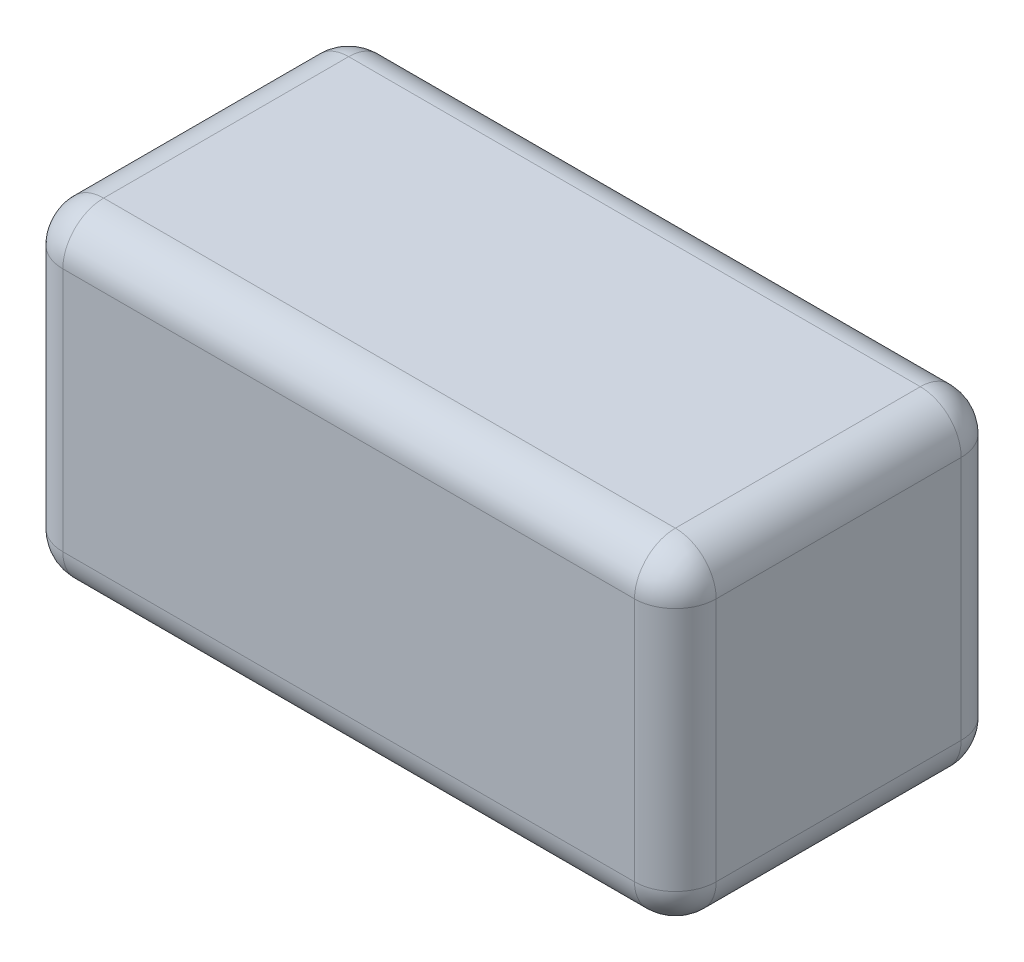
ISO-10303-21;
HEADER;
FILE_DESCRIPTION(('STEP AP214'),'2;1');
FILE_NAME('part.step','',(''),(''),'','','');
FILE_SCHEMA(('AUTOMOTIVE_DESIGN { 1 0 10303 214 1 1 1 1 }'));
ENDSEC;
DATA;
#1=APPLICATION_CONTEXT('core data for automotive mechanical design processes');
#2=APPLICATION_PROTOCOL_DEFINITION('international standard','automotive_design',2000,#1);
#3=PRODUCT_CONTEXT('',#1,'mechanical');
#4=PRODUCT('Part','Part','',(#3));
#5=PRODUCT_RELATED_PRODUCT_CATEGORY('part','',(#4));
#6=PRODUCT_DEFINITION_FORMATION('','',#4);
#7=PRODUCT_DEFINITION_CONTEXT('part definition',#1,'design');
#8=PRODUCT_DEFINITION('design','',#6,#7);
#9=PRODUCT_DEFINITION_SHAPE('','',#8);
#10=(LENGTH_UNIT() NAMED_UNIT(*) SI_UNIT(.MILLI.,.METRE.));
#11=(NAMED_UNIT(*) PLANE_ANGLE_UNIT() SI_UNIT($,.RADIAN.));
#12=(NAMED_UNIT(*) SI_UNIT($,.STERADIAN.) SOLID_ANGLE_UNIT());
#13=UNCERTAINTY_MEASURE_WITH_UNIT(LENGTH_MEASURE(1.E-05),#10,'distance_accuracy_value','');
#14=(GEOMETRIC_REPRESENTATION_CONTEXT(3) GLOBAL_UNCERTAINTY_ASSIGNED_CONTEXT((#13)) GLOBAL_UNIT_ASSIGNED_CONTEXT((#10,
#11,#12)) REPRESENTATION_CONTEXT('',''));
#15=CARTESIAN_POINT('',(0.,0.,0.));
#16=DIRECTION('',(0.,0.,1.));
#17=DIRECTION('',(1.,0.,0.));
#18=AXIS2_PLACEMENT_3D('',#15,#16,#17);
#19=CARTESIAN_POINT('',(-0.7,-0.3,0.7));
#20=DIRECTION('',(-1.,0.,0.));
#21=DIRECTION('',(0.,1.,0.));
#22=AXIS2_PLACEMENT_3D('',#19,#20,#21);
#23=SPHERICAL_SURFACE('',#22,0.1);
#24=CARTESIAN_POINT('',(-0.7,-0.3,0.7));
#25=DIRECTION('',(0.,0.,1.));
#26=DIRECTION('',(1.,0.,0.));
#27=AXIS2_PLACEMENT_3D('',#24,#25,#26);
#28=CIRCLE('',#27,0.1);
#29=CARTESIAN_POINT('',(-0.7,-0.4,0.7));
#30=VERTEX_POINT('',#29);
#31=CARTESIAN_POINT('',(-0.8,-0.3,0.7));
#32=VERTEX_POINT('',#31);
#33=EDGE_CURVE('E125',#30,#32,#28,.F.);
#34=ORIENTED_EDGE('',*,*,#33,.F.);
#35=CARTESIAN_POINT('',(-0.7,-0.3,0.7));
#36=DIRECTION('',(-1.,0.,0.));
#37=DIRECTION('',(0.,0.,1.));
#38=AXIS2_PLACEMENT_3D('',#35,#36,#37);
#39=CIRCLE('',#38,0.1);
#40=CARTESIAN_POINT('',(-0.7,-0.3,0.8));
#41=VERTEX_POINT('',#40);
#42=EDGE_CURVE('E278',#41,#30,#39,.F.);
#43=ORIENTED_EDGE('',*,*,#42,.F.);
#44=CARTESIAN_POINT('',(-0.7,-0.3,0.7));
#45=DIRECTION('',(0.,1.,0.));
#46=DIRECTION('',(0.,0.,1.));
#47=AXIS2_PLACEMENT_3D('',#44,#45,#46);
#48=CIRCLE('',#47,0.1);
#49=EDGE_CURVE('E275',#32,#41,#48,.T.);
#50=ORIENTED_EDGE('',*,*,#49,.F.);
#51=EDGE_LOOP('',(#34,#43,#50));
#52=FACE_BOUND('',#51,.T.);
#53=ADVANCED_FACE('F17',(#52),#23,.T.);
#54=CARTESIAN_POINT('',(0.7,-0.3,0.7));
#55=DIRECTION('',(1.,0.,0.));
#56=DIRECTION('',(0.,0.,-1.));
#57=AXIS2_PLACEMENT_3D('',#54,#55,#56);
#58=SPHERICAL_SURFACE('',#57,0.1);
#59=CARTESIAN_POINT('',(0.7,-0.3,0.7));
#60=DIRECTION('',(0.,-1.,0.));
#61=DIRECTION('',(1.,0.,0.));
#62=AXIS2_PLACEMENT_3D('',#59,#60,#61);
#63=CIRCLE('',#62,0.1);
#64=CARTESIAN_POINT('',(0.7,-0.300000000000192,0.8));
#65=VERTEX_POINT('',#64);
#66=CARTESIAN_POINT('',(0.8,-0.3,0.7));
#67=VERTEX_POINT('',#66);
#68=EDGE_CURVE('E269',#65,#67,#63,.F.);
#69=ORIENTED_EDGE('',*,*,#68,.F.);
#70=CARTESIAN_POINT('',(0.7,-0.3,0.7));
#71=DIRECTION('',(-1.,0.,0.));
#72=DIRECTION('',(0.,-1.,0.));
#73=AXIS2_PLACEMENT_3D('',#70,#71,#72);
#74=CIRCLE('',#73,0.1);
#75=CARTESIAN_POINT('',(0.7,-0.4,0.7));
#76=VERTEX_POINT('',#75);
#77=EDGE_CURVE('E272',#76,#65,#74,.T.);
#78=ORIENTED_EDGE('',*,*,#77,.F.);
#79=CARTESIAN_POINT('',(0.7,-0.3,0.7));
#80=DIRECTION('',(0.,0.,1.));
#81=DIRECTION('',(1.,0.,0.));
#82=AXIS2_PLACEMENT_3D('',#79,#80,#81);
#83=CIRCLE('',#82,0.1);
#84=EDGE_CURVE('E263',#67,#76,#83,.F.);
#85=ORIENTED_EDGE('',*,*,#84,.F.);
#86=EDGE_LOOP('',(#69,#78,#85));
#87=FACE_BOUND('',#86,.T.);
#88=ADVANCED_FACE('F152',(#87),#58,.T.);
#89=CARTESIAN_POINT('',(0.7,-0.3,0.1));
#90=DIRECTION('',(1.,0.,0.));
#91=DIRECTION('',(0.,0.,-1.));
#92=AXIS2_PLACEMENT_3D('',#89,#90,#91);
#93=SPHERICAL_SURFACE('',#92,0.1);
#94=CARTESIAN_POINT('',(0.7,-0.3,0.1));
#95=DIRECTION('',(-1.,0.,0.));
#96=DIRECTION('',(0.,-1.,0.));
#97=AXIS2_PLACEMENT_3D('',#94,#95,#96);
#98=CIRCLE('',#97,0.1);
#99=CARTESIAN_POINT('',(0.7,-0.3,0.));
#100=VERTEX_POINT('',#99);
#101=CARTESIAN_POINT('',(0.7,-0.4,0.0999999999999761));
#102=VERTEX_POINT('',#101);
#103=EDGE_CURVE('E113',#100,#102,#98,.T.);
#104=ORIENTED_EDGE('',*,*,#103,.F.);
#105=CARTESIAN_POINT('',(0.7,-0.3,0.1));
#106=DIRECTION('',(0.,-1.,0.));
#107=DIRECTION('',(1.,0.,0.));
#108=AXIS2_PLACEMENT_3D('',#105,#106,#107);
#109=CIRCLE('',#108,0.1);
#110=CARTESIAN_POINT('',(0.8,-0.3,0.1));
#111=VERTEX_POINT('',#110);
#112=EDGE_CURVE('E258',#111,#100,#109,.F.);
#113=ORIENTED_EDGE('',*,*,#112,.F.);
#114=CARTESIAN_POINT('',(0.7,-0.3,0.1));
#115=DIRECTION('',(0.,0.,1.));
#116=DIRECTION('',(1.,0.,0.));
#117=AXIS2_PLACEMENT_3D('',#114,#115,#116);
#118=CIRCLE('',#117,0.1);
#119=EDGE_CURVE('E266',#102,#111,#118,.T.);
#120=ORIENTED_EDGE('',*,*,#119,.F.);
#121=EDGE_LOOP('',(#104,#113,#120));
#122=FACE_BOUND('',#121,.T.);
#123=ADVANCED_FACE('F149',(#122),#93,.T.);
#124=CARTESIAN_POINT('',(-0.7,-0.3,0.1));
#125=DIRECTION('',(-1.,0.,0.));
#126=DIRECTION('',(0.,0.,1.));
#127=AXIS2_PLACEMENT_3D('',#124,#125,#126);
#128=SPHERICAL_SURFACE('',#127,0.1);
#129=CARTESIAN_POINT('',(-0.7,-0.3,0.1));
#130=DIRECTION('',(0.,1.,0.));
#131=DIRECTION('',(0.,0.,1.));
#132=AXIS2_PLACEMENT_3D('',#129,#130,#131);
#133=CIRCLE('',#132,0.1);
#134=CARTESIAN_POINT('',(-0.7,-0.300000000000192,0.));
#135=VERTEX_POINT('',#134);
#136=CARTESIAN_POINT('',(-0.8,-0.3,0.1));
#137=VERTEX_POINT('',#136);
#138=EDGE_CURVE('E132',#135,#137,#133,.T.);
#139=ORIENTED_EDGE('',*,*,#138,.F.);
#140=CARTESIAN_POINT('',(-0.7,-0.3,0.1));
#141=DIRECTION('',(-1.,0.,0.));
#142=DIRECTION('',(0.,0.,1.));
#143=AXIS2_PLACEMENT_3D('',#140,#141,#142);
#144=CIRCLE('',#143,0.1);
#145=CARTESIAN_POINT('',(-0.7,-0.4,0.1));
#146=VERTEX_POINT('',#145);
#147=EDGE_CURVE('E110',#146,#135,#144,.F.);
#148=ORIENTED_EDGE('',*,*,#147,.F.);
#149=CARTESIAN_POINT('',(-0.7,-0.3,0.1));
#150=DIRECTION('',(0.,0.,1.));
#151=DIRECTION('',(1.,0.,0.));
#152=AXIS2_PLACEMENT_3D('',#149,#150,#151);
#153=CIRCLE('',#152,0.1);
#154=EDGE_CURVE('E126',#137,#146,#153,.T.);
#155=ORIENTED_EDGE('',*,*,#154,.F.);
#156=EDGE_LOOP('',(#139,#148,#155));
#157=FACE_BOUND('',#156,.T.);
#158=ADVANCED_FACE('F130',(#157),#128,.T.);
#159=CARTESIAN_POINT('',(-0.7,-0.3,0.));
#160=DIRECTION('',(0.,0.,1.));
#161=DIRECTION('',(1.,0.,0.));
#162=AXIS2_PLACEMENT_3D('',#159,#160,#161);
#163=CYLINDRICAL_SURFACE('',#162,0.1);
#164=ORIENTED_EDGE('',*,*,#33,.T.);
#165=DIRECTION('',(0.,0.,1.));
#166=VECTOR('',#165,1.);
#167=CARTESIAN_POINT('',(-0.8,-0.3,0.));
#168=LINE('',#167,#166);
#169=EDGE_CURVE('E137',#137,#32,#168,.T.);
#170=ORIENTED_EDGE('',*,*,#169,.F.);
#171=ORIENTED_EDGE('',*,*,#154,.T.);
#172=DIRECTION('',(0.,0.,1.));
#173=VECTOR('',#172,1.);
#174=CARTESIAN_POINT('',(-0.7,-0.4,0.));
#175=LINE('',#174,#173);
#176=EDGE_CURVE('E120',#146,#30,#175,.T.);
#177=ORIENTED_EDGE('',*,*,#176,.T.);
#178=EDGE_LOOP('',(#164,#170,#171,#177));
#179=FACE_BOUND('',#178,.T.);
#180=ADVANCED_FACE('F135',(#179),#163,.T.);
#181=CARTESIAN_POINT('',(-0.7,-0.4,0.7));
#182=DIRECTION('',(0.,1.,0.));
#183=DIRECTION('',(0.,0.,1.));
#184=AXIS2_PLACEMENT_3D('',#181,#182,#183);
#185=CYLINDRICAL_SURFACE('',#184,0.1);
#186=CARTESIAN_POINT('',(-0.7,0.3,0.7));
#187=DIRECTION('',(0.,1.,0.));
#188=DIRECTION('',(-1.,0.,0.));
#189=AXIS2_PLACEMENT_3D('',#186,#187,#188);
#190=CIRCLE('',#189,0.1);
#191=CARTESIAN_POINT('',(-0.8,0.3,0.7));
#192=VERTEX_POINT('',#191);
#193=CARTESIAN_POINT('',(-0.7,0.3,0.8));
#194=VERTEX_POINT('',#193);
#195=EDGE_CURVE('E247',#192,#194,#190,.T.);
#196=ORIENTED_EDGE('',*,*,#195,.F.);
#197=DIRECTION('',(0.,1.,0.));
#198=VECTOR('',#197,1.);
#199=CARTESIAN_POINT('',(-0.8,-0.4,0.7));
#200=LINE('',#199,#198);
#201=EDGE_CURVE('E250',#32,#192,#200,.T.);
#202=ORIENTED_EDGE('',*,*,#201,.F.);
#203=ORIENTED_EDGE('',*,*,#49,.T.);
#204=DIRECTION('',(0.,1.,0.));
#205=VECTOR('',#204,1.);
#206=CARTESIAN_POINT('',(-0.7,0.,0.8));
#207=LINE('',#206,#205);
#208=EDGE_CURVE('E364',#41,#194,#207,.T.);
#209=ORIENTED_EDGE('',*,*,#208,.T.);
#210=EDGE_LOOP('',(#196,#202,#203,#209));
#211=FACE_BOUND('',#210,.T.);
#212=ADVANCED_FACE('F283',(#211),#185,.T.);
#213=CARTESIAN_POINT('',(0.7,0.4,0.7));
#214=DIRECTION('',(0.,-1.,0.));
#215=DIRECTION('',(1.,0.,0.));
#216=AXIS2_PLACEMENT_3D('',#213,#214,#215);
#217=CYLINDRICAL_SURFACE('',#216,0.1);
#218=DIRECTION('',(0.,1.,0.));
#219=VECTOR('',#218,1.);
#220=CARTESIAN_POINT('',(0.7,0.,0.8));
#221=LINE('',#220,#219);
#222=CARTESIAN_POINT('',(0.7,0.3,0.8));
#223=VERTEX_POINT('',#222);
#224=EDGE_CURVE('E363',#223,#65,#221,.F.);
#225=ORIENTED_EDGE('',*,*,#224,.T.);
#226=ORIENTED_EDGE('',*,*,#68,.T.);
#227=DIRECTION('',(0.,1.,0.));
#228=VECTOR('',#227,1.);
#229=CARTESIAN_POINT('',(0.8,0.4,0.7));
#230=LINE('',#229,#228);
#231=CARTESIAN_POINT('',(0.8,0.3,0.7));
#232=VERTEX_POINT('',#231);
#233=EDGE_CURVE('E216',#232,#67,#230,.F.);
#234=ORIENTED_EDGE('',*,*,#233,.F.);
#235=CARTESIAN_POINT('',(0.7,0.3,0.7));
#236=DIRECTION('',(0.,-1.,0.));
#237=DIRECTION('',(1.,0.,0.));
#238=AXIS2_PLACEMENT_3D('',#235,#236,#237);
#239=CIRCLE('',#238,0.1);
#240=EDGE_CURVE('E222',#223,#232,#239,.F.);
#241=ORIENTED_EDGE('',*,*,#240,.F.);
#242=EDGE_LOOP('',(#225,#226,#234,#241));
#243=FACE_BOUND('',#242,.T.);
#244=ADVANCED_FACE('F361',(#243),#217,.T.);
#245=CARTESIAN_POINT('',(0.7,-0.3,0.));
#246=DIRECTION('',(0.,0.,1.));
#247=DIRECTION('',(1.,0.,0.));
#248=AXIS2_PLACEMENT_3D('',#245,#246,#247);
#249=CYLINDRICAL_SURFACE('',#248,0.1);
#250=ORIENTED_EDGE('',*,*,#84,.T.);
#251=DIRECTION('',(0.,0.,1.));
#252=VECTOR('',#251,1.);
#253=CARTESIAN_POINT('',(0.7,-0.4,0.));
#254=LINE('',#253,#252);
#255=EDGE_CURVE('E261',#76,#102,#254,.F.);
#256=ORIENTED_EDGE('',*,*,#255,.T.);
#257=ORIENTED_EDGE('',*,*,#119,.T.);
#258=DIRECTION('',(0.,0.,1.));
#259=VECTOR('',#258,1.);
#260=CARTESIAN_POINT('',(0.8,-0.3,0.));
#261=LINE('',#260,#259);
#262=EDGE_CURVE('E213',#67,#111,#261,.F.);
#263=ORIENTED_EDGE('',*,*,#262,.F.);
#264=EDGE_LOOP('',(#250,#256,#257,#263));
#265=FACE_BOUND('',#264,.T.);
#266=ADVANCED_FACE('F357',(#265),#249,.T.);
#267=CARTESIAN_POINT('',(0.7,0.4,0.1));
#268=DIRECTION('',(0.,-1.,0.));
#269=DIRECTION('',(1.,0.,0.));
#270=AXIS2_PLACEMENT_3D('',#267,#268,#269);
#271=CYLINDRICAL_SURFACE('',#270,0.1);
#272=DIRECTION('',(0.,1.,0.));
#273=VECTOR('',#272,1.);
#274=CARTESIAN_POINT('',(0.7,0.,0.));
#275=LINE('',#274,#273);
#276=CARTESIAN_POINT('',(0.7,0.300000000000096,0.));
#277=VERTEX_POINT('',#276);
#278=EDGE_CURVE('E117',#277,#100,#275,.F.);
#279=ORIENTED_EDGE('',*,*,#278,.F.);
#280=CARTESIAN_POINT('',(0.7,0.3,0.1));
#281=DIRECTION('',(0.,1.,3.83281150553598E-12));
#282=DIRECTION('',(1.,0.,0.));
#283=AXIS2_PLACEMENT_3D('',#280,#281,#282);
#284=CIRCLE('',#283,0.1);
#285=CARTESIAN_POINT('',(0.8,0.3,0.1));
#286=VERTEX_POINT('',#285);
#287=EDGE_CURVE('E206',#286,#277,#284,.T.);
#288=ORIENTED_EDGE('',*,*,#287,.F.);
#289=DIRECTION('',(0.,1.,0.));
#290=VECTOR('',#289,1.);
#291=CARTESIAN_POINT('',(0.8,0.4,0.1));
#292=LINE('',#291,#290);
#293=EDGE_CURVE('E219',#111,#286,#292,.T.);
#294=ORIENTED_EDGE('',*,*,#293,.F.);
#295=ORIENTED_EDGE('',*,*,#112,.T.);
#296=EDGE_LOOP('',(#279,#288,#294,#295));
#297=FACE_BOUND('',#296,.T.);
#298=ADVANCED_FACE('F355',(#297),#271,.T.);
#299=CARTESIAN_POINT('',(0.5,-0.4,0.));
#300=DIRECTION('',(0.,-1.,0.));
#301=DIRECTION('',(0.,0.,-1.));
#302=AXIS2_PLACEMENT_3D('',#299,#300,#301);
#303=PLANE('',#302);
#304=DIRECTION('',(-1.,0.,0.));
#305=VECTOR('',#304,1.);
#306=CARTESIAN_POINT('',(0.5,-0.4,0.7));
#307=LINE('',#306,#305);
#308=EDGE_CURVE('E101',#30,#76,#307,.F.);
#309=ORIENTED_EDGE('',*,*,#308,.F.);
#310=ORIENTED_EDGE('',*,*,#176,.F.);
#311=DIRECTION('',(-1.,0.,0.));
#312=VECTOR('',#311,1.);
#313=CARTESIAN_POINT('',(0.5,-0.4,0.1));
#314=LINE('',#313,#312);
#315=EDGE_CURVE('E107',#102,#146,#314,.T.);
#316=ORIENTED_EDGE('',*,*,#315,.F.);
#317=ORIENTED_EDGE('',*,*,#255,.F.);
#318=EDGE_LOOP('',(#309,#310,#316,#317));
#319=FACE_BOUND('',#318,.T.);
#320=ADVANCED_FACE('F121',(#319),#303,.T.);
#321=CARTESIAN_POINT('',(-0.7,-0.4,0.1));
#322=DIRECTION('',(0.,1.,0.));
#323=DIRECTION('',(0.,0.,1.));
#324=AXIS2_PLACEMENT_3D('',#321,#322,#323);
#325=CYLINDRICAL_SURFACE('',#324,0.1);
#326=DIRECTION('',(0.,1.,0.));
#327=VECTOR('',#326,1.);
#328=CARTESIAN_POINT('',(-0.7,0.,0.));
#329=LINE('',#328,#327);
#330=CARTESIAN_POINT('',(-0.7,0.3,0.));
#331=VERTEX_POINT('',#330);
#332=EDGE_CURVE('E116',#135,#331,#329,.T.);
#333=ORIENTED_EDGE('',*,*,#332,.F.);
#334=ORIENTED_EDGE('',*,*,#138,.T.);
#335=DIRECTION('',(0.,1.,0.));
#336=VECTOR('',#335,1.);
#337=CARTESIAN_POINT('',(-0.8,-0.4,0.1));
#338=LINE('',#337,#336);
#339=CARTESIAN_POINT('',(-0.8,0.3,0.1));
#340=VERTEX_POINT('',#339);
#341=EDGE_CURVE('E254',#340,#137,#338,.F.);
#342=ORIENTED_EDGE('',*,*,#341,.F.);
#343=CARTESIAN_POINT('',(-0.7,0.3,0.1));
#344=DIRECTION('',(0.,-1.,0.));
#345=DIRECTION('',(-1.,0.,0.));
#346=AXIS2_PLACEMENT_3D('',#343,#344,#345);
#347=CIRCLE('',#346,0.1);
#348=EDGE_CURVE('E208',#331,#340,#347,.F.);
#349=ORIENTED_EDGE('',*,*,#348,.F.);
#350=EDGE_LOOP('',(#333,#334,#342,#349));
#351=FACE_BOUND('',#350,.T.);
#352=ADVANCED_FACE('F294',(#351),#325,.T.);
#353=CARTESIAN_POINT('',(-0.8,-0.4,0.));
#354=DIRECTION('',(-1.,0.,0.));
#355=DIRECTION('',(0.,0.,1.));
#356=AXIS2_PLACEMENT_3D('',#353,#354,#355);
#357=PLANE('',#356);
#358=ORIENTED_EDGE('',*,*,#201,.T.);
#359=DIRECTION('',(0.,0.,1.));
#360=VECTOR('',#359,1.);
#361=CARTESIAN_POINT('',(-0.8,0.3,0.));
#362=LINE('',#361,#360);
#363=EDGE_CURVE('E290',#340,#192,#362,.T.);
#364=ORIENTED_EDGE('',*,*,#363,.F.);
#365=ORIENTED_EDGE('',*,*,#341,.T.);
#366=ORIENTED_EDGE('',*,*,#169,.T.);
#367=EDGE_LOOP('',(#358,#364,#365,#366));
#368=FACE_BOUND('',#367,.T.);
#369=ADVANCED_FACE('F240',(#368),#357,.T.);
#370=CARTESIAN_POINT('',(-0.7,0.3,0.7));
#371=DIRECTION('',(-1.,0.,0.));
#372=DIRECTION('',(0.,1.,0.));
#373=AXIS2_PLACEMENT_3D('',#370,#371,#372);
#374=SPHERICAL_SURFACE('',#373,0.1);
#375=CARTESIAN_POINT('',(-0.7,0.3,0.7));
#376=DIRECTION('',(1.,0.,0.));
#377=DIRECTION('',(0.,0.,-1.));
#378=AXIS2_PLACEMENT_3D('',#375,#376,#377);
#379=CIRCLE('',#378,0.1);
#380=CARTESIAN_POINT('',(-0.7,0.4,0.7));
#381=VERTEX_POINT('',#380);
#382=EDGE_CURVE('E316',#381,#194,#379,.T.);
#383=ORIENTED_EDGE('',*,*,#382,.F.);
#384=CARTESIAN_POINT('',(-0.7,0.3,0.7));
#385=DIRECTION('',(0.,0.,1.));
#386=DIRECTION('',(1.,0.,0.));
#387=AXIS2_PLACEMENT_3D('',#384,#385,#386);
#388=CIRCLE('',#387,0.1);
#389=EDGE_CURVE('E313',#192,#381,#388,.F.);
#390=ORIENTED_EDGE('',*,*,#389,.F.);
#391=ORIENTED_EDGE('',*,*,#195,.T.);
#392=EDGE_LOOP('',(#383,#390,#391));
#393=FACE_BOUND('',#392,.T.);
#394=ADVANCED_FACE('F235',(#393),#374,.T.);
#395=CARTESIAN_POINT('',(0.5,-0.3,0.7));
#396=DIRECTION('',(-1.,0.,0.));
#397=DIRECTION('',(0.,0.,1.));
#398=AXIS2_PLACEMENT_3D('',#395,#396,#397);
#399=CYLINDRICAL_SURFACE('',#398,0.1);
#400=DIRECTION('',(-1.,0.,0.));
#401=VECTOR('',#400,1.);
#402=CARTESIAN_POINT('',(0.,-0.3,0.8));
#403=LINE('',#402,#401);
#404=EDGE_CURVE('E319',#65,#41,#403,.T.);
#405=ORIENTED_EDGE('',*,*,#404,.T.);
#406=ORIENTED_EDGE('',*,*,#42,.T.);
#407=ORIENTED_EDGE('',*,*,#308,.T.);
#408=ORIENTED_EDGE('',*,*,#77,.T.);
#409=EDGE_LOOP('',(#405,#406,#407,#408));
#410=FACE_BOUND('',#409,.T.);
#411=ADVANCED_FACE('F231',(#410),#399,.T.);
#412=CARTESIAN_POINT('',(0.7,0.3,0.7));
#413=DIRECTION('',(1.,0.,0.));
#414=DIRECTION('',(0.,0.,1.));
#415=AXIS2_PLACEMENT_3D('',#412,#413,#414);
#416=SPHERICAL_SURFACE('',#415,0.1);
#417=CARTESIAN_POINT('',(0.7,0.3,0.7));
#418=DIRECTION('',(1.,0.,0.));
#419=DIRECTION('',(0.,1.,0.));
#420=AXIS2_PLACEMENT_3D('',#417,#418,#419);
#421=CIRCLE('',#420,0.1);
#422=CARTESIAN_POINT('',(0.7,0.4,0.7));
#423=VERTEX_POINT('',#422);
#424=EDGE_CURVE('E321',#223,#423,#421,.F.);
#425=ORIENTED_EDGE('',*,*,#424,.F.);
#426=ORIENTED_EDGE('',*,*,#240,.T.);
#427=CARTESIAN_POINT('',(0.7,0.3,0.7));
#428=DIRECTION('',(0.,0.,1.));
#429=DIRECTION('',(1.,0.,0.));
#430=AXIS2_PLACEMENT_3D('',#427,#428,#429);
#431=CIRCLE('',#430,0.1);
#432=EDGE_CURVE('E327',#423,#232,#431,.F.);
#433=ORIENTED_EDGE('',*,*,#432,.F.);
#434=EDGE_LOOP('',(#425,#426,#433));
#435=FACE_BOUND('',#434,.T.);
#436=ADVANCED_FACE('F227',(#435),#416,.T.);
#437=CARTESIAN_POINT('',(0.8,0.4,0.));
#438=DIRECTION('',(1.,0.,0.));
#439=DIRECTION('',(0.,1.,0.));
#440=AXIS2_PLACEMENT_3D('',#437,#438,#439);
#441=PLANE('',#440);
#442=ORIENTED_EDGE('',*,*,#233,.T.);
#443=ORIENTED_EDGE('',*,*,#262,.T.);
#444=ORIENTED_EDGE('',*,*,#293,.T.);
#445=DIRECTION('',(0.,0.,1.));
#446=VECTOR('',#445,1.);
#447=CARTESIAN_POINT('',(0.8,0.3,0.));
#448=LINE('',#447,#446);
#449=EDGE_CURVE('E303',#232,#286,#448,.F.);
#450=ORIENTED_EDGE('',*,*,#449,.F.);
#451=EDGE_LOOP('',(#442,#443,#444,#450));
#452=FACE_BOUND('',#451,.T.);
#453=ADVANCED_FACE('F230',(#452),#441,.T.);
#454=CARTESIAN_POINT('',(-0.7,0.3,0.1));
#455=DIRECTION('',(-1.,0.,0.));
#456=DIRECTION('',(0.,0.,-1.));
#457=AXIS2_PLACEMENT_3D('',#454,#455,#456);
#458=SPHERICAL_SURFACE('',#457,0.1);
#459=CARTESIAN_POINT('',(-0.7,0.3,0.1));
#460=DIRECTION('',(1.,0.,0.));
#461=DIRECTION('',(0.,0.,-1.));
#462=AXIS2_PLACEMENT_3D('',#459,#460,#461);
#463=CIRCLE('',#462,0.1);
#464=CARTESIAN_POINT('',(-0.7,0.4,0.0999999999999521));
#465=VERTEX_POINT('',#464);
#466=EDGE_CURVE('E299',#331,#465,#463,.T.);
#467=ORIENTED_EDGE('',*,*,#466,.F.);
#468=ORIENTED_EDGE('',*,*,#348,.T.);
#469=CARTESIAN_POINT('',(-0.7,0.3,0.1));
#470=DIRECTION('',(0.,0.,1.));
#471=DIRECTION('',(1.,0.,0.));
#472=AXIS2_PLACEMENT_3D('',#469,#470,#471);
#473=CIRCLE('',#472,0.1);
#474=EDGE_CURVE('E298',#465,#340,#473,.T.);
#475=ORIENTED_EDGE('',*,*,#474,.F.);
#476=EDGE_LOOP('',(#467,#468,#475));
#477=FACE_BOUND('',#476,.T.);
#478=ADVANCED_FACE('F199',(#477),#458,.T.);
#479=CARTESIAN_POINT('',(0.7,0.3,0.1));
#480=DIRECTION('',(1.,0.,0.));
#481=DIRECTION('',(0.,0.,1.));
#482=AXIS2_PLACEMENT_3D('',#479,#480,#481);
#483=SPHERICAL_SURFACE('',#482,0.1);
#484=ORIENTED_EDGE('',*,*,#287,.T.);
#485=CARTESIAN_POINT('',(0.7,0.3,0.1));
#486=DIRECTION('',(1.,0.,0.));
#487=DIRECTION('',(0.,1.,0.));
#488=AXIS2_PLACEMENT_3D('',#485,#486,#487);
#489=CIRCLE('',#488,0.1);
#490=CARTESIAN_POINT('',(0.7,0.4,0.1));
#491=VERTEX_POINT('',#490);
#492=EDGE_CURVE('E302',#491,#277,#489,.F.);
#493=ORIENTED_EDGE('',*,*,#492,.F.);
#494=CARTESIAN_POINT('',(0.7,0.3,0.1));
#495=DIRECTION('',(0.,0.,1.));
#496=DIRECTION('',(1.,0.,0.));
#497=AXIS2_PLACEMENT_3D('',#494,#495,#496);
#498=CIRCLE('',#497,0.1);
#499=EDGE_CURVE('E324',#286,#491,#498,.T.);
#500=ORIENTED_EDGE('',*,*,#499,.F.);
#501=EDGE_LOOP('',(#484,#493,#500));
#502=FACE_BOUND('',#501,.T.);
#503=ADVANCED_FACE('F195',(#502),#483,.T.);
#504=CARTESIAN_POINT('',(0.5,-0.3,0.1));
#505=DIRECTION('',(-1.,0.,0.));
#506=DIRECTION('',(0.,0.,1.));
#507=AXIS2_PLACEMENT_3D('',#504,#505,#506);
#508=CYLINDRICAL_SURFACE('',#507,0.1);
#509=ORIENTED_EDGE('',*,*,#315,.T.);
#510=ORIENTED_EDGE('',*,*,#147,.T.);
#511=DIRECTION('',(-1.,0.,0.));
#512=VECTOR('',#511,1.);
#513=CARTESIAN_POINT('',(0.,-0.3,0.));
#514=LINE('',#513,#512);
#515=EDGE_CURVE('E308',#100,#135,#514,.T.);
#516=ORIENTED_EDGE('',*,*,#515,.F.);
#517=ORIENTED_EDGE('',*,*,#103,.T.);
#518=EDGE_LOOP('',(#509,#510,#516,#517));
#519=FACE_BOUND('',#518,.T.);
#520=ADVANCED_FACE('F108',(#519),#508,.T.);
#521=CARTESIAN_POINT('',(-0.7,0.3,0.));
#522=DIRECTION('',(0.,0.,1.));
#523=DIRECTION('',(1.,0.,0.));
#524=AXIS2_PLACEMENT_3D('',#521,#522,#523);
#525=CYLINDRICAL_SURFACE('',#524,0.1);
#526=ORIENTED_EDGE('',*,*,#389,.T.);
#527=DIRECTION('',(0.,0.,1.));
#528=VECTOR('',#527,1.);
#529=CARTESIAN_POINT('',(-0.7,0.4,0.));
#530=LINE('',#529,#528);
#531=EDGE_CURVE('E334',#465,#381,#530,.T.);
#532=ORIENTED_EDGE('',*,*,#531,.F.);
#533=ORIENTED_EDGE('',*,*,#474,.T.);
#534=ORIENTED_EDGE('',*,*,#363,.T.);
#535=EDGE_LOOP('',(#526,#532,#533,#534));
#536=FACE_BOUND('',#535,.T.);
#537=ADVANCED_FACE('F188',(#536),#525,.T.);
#538=CARTESIAN_POINT('',(0.,0.,0.8));
#539=DIRECTION('',(0.,0.,-1.));
#540=DIRECTION('',(-1.,0.,0.));
#541=AXIS2_PLACEMENT_3D('',#538,#539,#540);
#542=PLANE('',#541);
#543=DIRECTION('',(1.,0.,0.));
#544=VECTOR('',#543,1.);
#545=CARTESIAN_POINT('',(-0.5,0.3,0.8));
#546=LINE('',#545,#544);
#547=EDGE_CURVE('E337',#194,#223,#546,.T.);
#548=ORIENTED_EDGE('',*,*,#547,.F.);
#549=ORIENTED_EDGE('',*,*,#208,.F.);
#550=ORIENTED_EDGE('',*,*,#404,.F.);
#551=ORIENTED_EDGE('',*,*,#224,.F.);
#552=EDGE_LOOP('',(#548,#549,#550,#551));
#553=FACE_BOUND('',#552,.T.);
#554=ADVANCED_FACE('F184',(#553),#542,.F.);
#555=CARTESIAN_POINT('',(0.7,0.3,0.));
#556=DIRECTION('',(0.,0.,1.));
#557=DIRECTION('',(1.,0.,0.));
#558=AXIS2_PLACEMENT_3D('',#555,#556,#557);
#559=CYLINDRICAL_SURFACE('',#558,0.1);
#560=ORIENTED_EDGE('',*,*,#432,.T.);
#561=ORIENTED_EDGE('',*,*,#449,.T.);
#562=ORIENTED_EDGE('',*,*,#499,.T.);
#563=DIRECTION('',(0.,0.,1.));
#564=VECTOR('',#563,1.);
#565=CARTESIAN_POINT('',(0.7,0.4,0.));
#566=LINE('',#565,#564);
#567=EDGE_CURVE('E339',#423,#491,#566,.F.);
#568=ORIENTED_EDGE('',*,*,#567,.F.);
#569=EDGE_LOOP('',(#560,#561,#562,#568));
#570=FACE_BOUND('',#569,.T.);
#571=ADVANCED_FACE('F180',(#570),#559,.T.);
#572=CARTESIAN_POINT('',(0.,0.,0.));
#573=DIRECTION('',(0.,0.,-1.));
#574=DIRECTION('',(-1.,0.,0.));
#575=AXIS2_PLACEMENT_3D('',#572,#573,#574);
#576=PLANE('',#575);
#577=ORIENTED_EDGE('',*,*,#515,.T.);
#578=ORIENTED_EDGE('',*,*,#332,.T.);
#579=DIRECTION('',(1.,0.,0.));
#580=VECTOR('',#579,1.);
#581=CARTESIAN_POINT('',(-0.5,0.3,0.));
#582=LINE('',#581,#580);
#583=EDGE_CURVE('E306',#277,#331,#582,.F.);
#584=ORIENTED_EDGE('',*,*,#583,.F.);
#585=ORIENTED_EDGE('',*,*,#278,.T.);
#586=EDGE_LOOP('',(#577,#578,#584,#585));
#587=FACE_BOUND('',#586,.T.);
#588=ADVANCED_FACE('F176',(#587),#576,.T.);
#589=CARTESIAN_POINT('',(-0.5,0.3,0.7));
#590=DIRECTION('',(1.,0.,0.));
#591=DIRECTION('',(0.,0.,-1.));
#592=AXIS2_PLACEMENT_3D('',#589,#590,#591);
#593=CYLINDRICAL_SURFACE('',#592,0.1);
#594=ORIENTED_EDGE('',*,*,#547,.T.);
#595=ORIENTED_EDGE('',*,*,#424,.T.);
#596=DIRECTION('',(1.,0.,0.));
#597=VECTOR('',#596,1.);
#598=CARTESIAN_POINT('',(-0.5,0.4,0.7));
#599=LINE('',#598,#597);
#600=EDGE_CURVE('E26',#381,#423,#599,.T.);
#601=ORIENTED_EDGE('',*,*,#600,.F.);
#602=ORIENTED_EDGE('',*,*,#382,.T.);
#603=EDGE_LOOP('',(#594,#595,#601,#602));
#604=FACE_BOUND('',#603,.T.);
#605=ADVANCED_FACE('F171',(#604),#593,.T.);
#606=CARTESIAN_POINT('',(-0.5,0.3,0.1));
#607=DIRECTION('',(1.,0.,0.));
#608=DIRECTION('',(0.,0.,-1.));
#609=AXIS2_PLACEMENT_3D('',#606,#607,#608);
#610=CYLINDRICAL_SURFACE('',#609,0.1);
#611=DIRECTION('',(1.,0.,0.));
#612=VECTOR('',#611,1.);
#613=CARTESIAN_POINT('',(-0.5,0.4,0.1));
#614=LINE('',#613,#612);
#615=EDGE_CURVE('E11',#491,#465,#614,.F.);
#616=ORIENTED_EDGE('',*,*,#615,.F.);
#617=ORIENTED_EDGE('',*,*,#492,.T.);
#618=ORIENTED_EDGE('',*,*,#583,.T.);
#619=ORIENTED_EDGE('',*,*,#466,.T.);
#620=EDGE_LOOP('',(#616,#617,#618,#619));
#621=FACE_BOUND('',#620,.T.);
#622=ADVANCED_FACE('F165',(#621),#610,.T.);
#623=CARTESIAN_POINT('',(-0.5,0.4,0.));
#624=DIRECTION('',(0.,1.,0.));
#625=DIRECTION('',(0.,0.,1.));
#626=AXIS2_PLACEMENT_3D('',#623,#624,#625);
#627=PLANE('',#626);
#628=ORIENTED_EDGE('',*,*,#600,.T.);
#629=ORIENTED_EDGE('',*,*,#567,.T.);
#630=ORIENTED_EDGE('',*,*,#615,.T.);
#631=ORIENTED_EDGE('',*,*,#531,.T.);
#632=EDGE_LOOP('',(#628,#629,#630,#631));
#633=FACE_BOUND('',#632,.T.);
#634=ADVANCED_FACE('F163',(#633),#627,.T.);
#635=CLOSED_SHELL('',(#53,#88,#123,#158,#180,#212,#244,#266,#298,#320,#352,#369,#394,#411,#436,
#453,#478,#503,#520,#537,#554,#571,#588,#605,#622,#634));
#636=MANIFOLD_SOLID_BREP('B1',#635);
#637=ADVANCED_BREP_SHAPE_REPRESENTATION('',(#18,#636),#14);
#638=SHAPE_DEFINITION_REPRESENTATION(#9,#637);
ENDSEC;
END-ISO-10303-21;
